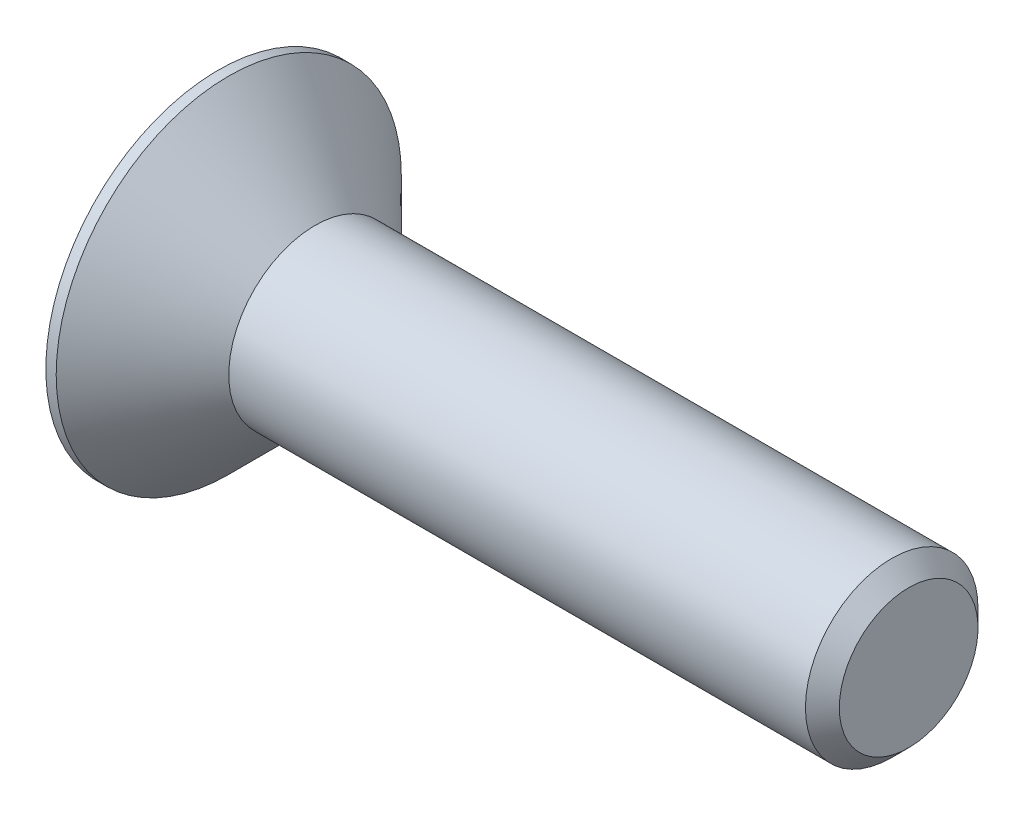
ISO-10303-21;
HEADER;
FILE_DESCRIPTION(('STEP AP214'),'2;1');
FILE_NAME('part.step','',(''),(''),'','','');
FILE_SCHEMA(('AUTOMOTIVE_DESIGN { 1 0 10303 214 1 1 1 1 }'));
ENDSEC;
DATA;
#1=APPLICATION_CONTEXT('core data for automotive mechanical design processes');
#2=APPLICATION_PROTOCOL_DEFINITION('international standard','automotive_design',2000,#1);
#3=PRODUCT_CONTEXT('',#1,'mechanical');
#4=PRODUCT('Part','Part','',(#3));
#5=PRODUCT_RELATED_PRODUCT_CATEGORY('part','',(#4));
#6=PRODUCT_DEFINITION_FORMATION('','',#4);
#7=PRODUCT_DEFINITION_CONTEXT('part definition',#1,'design');
#8=PRODUCT_DEFINITION('design','',#6,#7);
#9=PRODUCT_DEFINITION_SHAPE('','',#8);
#10=(LENGTH_UNIT() NAMED_UNIT(*) SI_UNIT(.MILLI.,.METRE.));
#11=(NAMED_UNIT(*) PLANE_ANGLE_UNIT() SI_UNIT($,.RADIAN.));
#12=(NAMED_UNIT(*) SI_UNIT($,.STERADIAN.) SOLID_ANGLE_UNIT());
#13=UNCERTAINTY_MEASURE_WITH_UNIT(LENGTH_MEASURE(1.E-05),#10,'distance_accuracy_value','');
#14=(GEOMETRIC_REPRESENTATION_CONTEXT(3) GLOBAL_UNCERTAINTY_ASSIGNED_CONTEXT((#13)) GLOBAL_UNIT_ASSIGNED_CONTEXT((#10,
#11,#12)) REPRESENTATION_CONTEXT('',''));
#15=CARTESIAN_POINT('',(0.,0.,0.));
#16=DIRECTION('',(0.,0.,1.));
#17=DIRECTION('',(1.,0.,0.));
#18=AXIS2_PLACEMENT_3D('',#15,#16,#17);
#19=CARTESIAN_POINT('',(0.,1.5,0.866025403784));
#20=DIRECTION('',(0.,1.,0.));
#21=DIRECTION('',(0.,0.,1.));
#22=AXIS2_PLACEMENT_3D('',#19,#20,#21);
#23=PLANE('',#22);
#24=DIRECTION('',(0.,0.,1.));
#25=VECTOR('',#24,1.);
#26=CARTESIAN_POINT('',(0.,1.5,0.866025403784));
#27=LINE('',#26,#25);
#28=CARTESIAN_POINT('',(0.,1.5,-0.866025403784));
#29=VERTEX_POINT('',#28);
#30=CARTESIAN_POINT('',(0.,1.50000000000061,0.866025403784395));
#31=VERTEX_POINT('',#30);
#32=EDGE_CURVE('E87',#29,#31,#27,.T.);
#33=ORIENTED_EDGE('',*,*,#32,.F.);
#34=DIRECTION('',(1.,0.,0.));
#35=VECTOR('',#34,1.);
#36=CARTESIAN_POINT('',(0.,1.5,-0.866025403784));
#37=LINE('',#36,#35);
#38=CARTESIAN_POINT('',(2.30000001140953,1.5,-0.866025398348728));
#39=VERTEX_POINT('',#38);
#40=EDGE_CURVE('E90',#29,#39,#37,.T.);
#41=ORIENTED_EDGE('',*,*,#40,.T.);
#42=CARTESIAN_POINT('',(2.30000000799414,1.49999999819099,0.866025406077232));
#43=CARTESIAN_POINT('',(2.32052467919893,1.49999999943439,0.794933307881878));
#44=CARTESIAN_POINT('',(2.3393155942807,1.49999999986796,0.723278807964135));
#45=CARTESIAN_POINT('',(2.37252620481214,1.50000000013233,0.578805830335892));
#46=CARTESIAN_POINT('',(2.38693611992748,1.49999999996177,0.505985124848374));
#47=CARTESIAN_POINT('',(2.41010900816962,1.50000000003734,0.361160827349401));
#48=CARTESIAN_POINT('',(2.41899552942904,1.50000000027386,0.289177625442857));
#49=CARTESIAN_POINT('',(2.43092515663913,1.49999999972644,0.144795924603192));
#50=CARTESIAN_POINT('',(2.43397460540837,1.49999999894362,0.0723979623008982));
#51=CARTESIAN_POINT('',(2.43397460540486,1.49999999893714,-0.0723979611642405));
#52=CARTESIAN_POINT('',(2.43092515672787,1.49999999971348,-0.144795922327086));
#53=CARTESIAN_POINT('',(2.41899552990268,1.50000000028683,-0.289177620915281));
#54=CARTESIAN_POINT('',(2.41010900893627,1.50000000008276,-0.361160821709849));
#55=CARTESIAN_POINT('',(2.38693612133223,1.49999999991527,-0.505985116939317));
#56=CARTESIAN_POINT('',(2.3725262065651,1.49999999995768,-0.578805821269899));
#57=CARTESIAN_POINT('',(2.33931559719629,1.50000000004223,-0.72327879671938));
#58=CARTESIAN_POINT('',(2.32052468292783,1.50000000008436,-0.794933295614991));
#59=CARTESIAN_POINT('',(2.30000001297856,1.5,-0.866025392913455));
#60=B_SPLINE_CURVE_WITH_KNOTS('',3,(#42,#43,#44,#45,#46,#47,#48,#49,#50,#51,#52,#53,#54,#55,#56,
#57,#58,#59),.UNSPECIFIED.,.F.,.F.,(4,2,2,2,2,2,2,2,4),(0.,0.222055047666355,0.444602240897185,
0.661973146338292,0.879107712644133,1.09624227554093,1.31361317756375,1.53616036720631,
1.7582154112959),.UNSPECIFIED.);
#61=CARTESIAN_POINT('',(2.3000000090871,1.50000000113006,0.866025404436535));
#62=VERTEX_POINT('',#61);
#63=EDGE_CURVE('E21',#62,#39,#60,.T.);
#64=ORIENTED_EDGE('',*,*,#63,.F.);
#65=DIRECTION('',(1.,0.,0.));
#66=VECTOR('',#65,1.);
#67=CARTESIAN_POINT('',(0.,1.50000000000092,0.866025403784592));
#68=LINE('',#67,#66);
#69=EDGE_CURVE('E129',#62,#31,#68,.F.);
#70=ORIENTED_EDGE('',*,*,#69,.T.);
#71=EDGE_LOOP('',(#33,#41,#64,#70));
#72=FACE_BOUND('',#71,.T.);
#73=ADVANCED_FACE('F17',(#72),#23,.F.);
#74=CARTESIAN_POINT('',(0.,0.,1.73205080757));
#75=DIRECTION('',(0.,0.50000000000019,0.866025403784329));
#76=DIRECTION('',(0.,-0.866025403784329,0.50000000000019));
#77=AXIS2_PLACEMENT_3D('',#74,#75,#76);
#78=PLANE('',#77);
#79=DIRECTION('',(0.,-0.866025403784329,0.50000000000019));
#80=VECTOR('',#79,1.);
#81=CARTESIAN_POINT('',(0.,0.,1.73205080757));
#82=LINE('',#81,#80);
#83=CARTESIAN_POINT('',(0.,-2.1098066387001E-09,1.73205080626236));
#84=VERTEX_POINT('',#83);
#85=EDGE_CURVE('E103',#31,#84,#82,.T.);
#86=ORIENTED_EDGE('',*,*,#85,.F.);
#87=ORIENTED_EDGE('',*,*,#69,.F.);
#88=CARTESIAN_POINT('',(2.30000000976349,-9.9609574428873E-10,1.7320508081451));
#89=CARTESIAN_POINT('',(2.32197835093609,0.0659159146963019,1.69399423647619));
#90=CARTESIAN_POINT('',(2.34196650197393,0.13240081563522,1.65560916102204));
#91=CARTESIAN_POINT('',(2.37685521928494,0.266521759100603,1.5781743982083));
#92=CARTESIAN_POINT('',(2.39174344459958,0.334160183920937,1.53912333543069));
#93=CARTESIAN_POINT('',(2.41491804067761,0.468598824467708,1.46150515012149));
#94=CARTESIAN_POINT('',(2.42335866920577,0.535378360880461,1.42294996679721));
#95=CARTESIAN_POINT('',(2.433433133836,0.669251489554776,1.3456582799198));
#96=CARTESIAN_POINT('',(2.43507531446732,0.736344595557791,1.30692205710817));
#97=CARTESIAN_POINT('',(2.43165029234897,0.861700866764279,1.23454758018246));
#98=CARTESIAN_POINT('',(2.427424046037,0.919982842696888,1.20089846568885));
#99=CARTESIAN_POINT('',(2.41403203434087,1.03616710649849,1.13381944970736));
#100=CARTESIAN_POINT('',(2.40486169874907,1.09406899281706,1.10038978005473));
#101=CARTESIAN_POINT('',(2.3819376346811,1.21049260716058,1.03317257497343));
#102=CARTESIAN_POINT('',(2.36808677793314,1.26899960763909,0.999393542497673));
#103=CARTESIAN_POINT('',(2.33665118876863,1.38514122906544,0.932339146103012));
#104=CARTESIAN_POINT('',(2.31907383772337,1.44277733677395,0.899062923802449));
#105=CARTESIAN_POINT('',(2.3000000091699,1.50000000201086,0.866025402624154));
#106=B_SPLINE_CURVE_WITH_KNOTS('',3,(#88,#89,#90,#91,#92,#93,#94,#95,#96,#97,#98,#99,#100,#101,
#102,#103,#104,#105),.UNSPECIFIED.,.F.,.F.,(4,2,2,2,2,2,2,2,4),(0.,0.237762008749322,
0.476095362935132,0.708530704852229,0.940680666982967,1.14278083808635,1.34506814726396,
1.55184121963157,1.75820848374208),.UNSPECIFIED.);
#107=CARTESIAN_POINT('',(2.30000001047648,-1.44596111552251E-09,1.73205080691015));
#108=VERTEX_POINT('',#107);
#109=EDGE_CURVE('E83',#108,#62,#106,.T.);
#110=ORIENTED_EDGE('',*,*,#109,.F.);
#111=DIRECTION('',(1.,0.,0.));
#112=VECTOR('',#111,1.);
#113=CARTESIAN_POINT('',(0.,-3.28006176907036E-09,1.73205080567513));
#114=LINE('',#113,#112);
#115=EDGE_CURVE('E204',#108,#84,#114,.F.);
#116=ORIENTED_EDGE('',*,*,#115,.T.);
#117=EDGE_LOOP('',(#86,#87,#110,#116));
#118=FACE_BOUND('',#117,.T.);
#119=ADVANCED_FACE('F130',(#118),#78,.F.);
#120=CARTESIAN_POINT('',(2.29400000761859,-5.11590769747E-10,0.));
#121=DIRECTION('',(-1.,0.,0.));
#122=DIRECTION('',(0.,0.,1.));
#123=AXIS2_PLACEMENT_3D('',#120,#121,#122);
#124=CONICAL_SURFACE('',#123,1.74244311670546,1.04719755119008);
#125=CARTESIAN_POINT('',(3.30000001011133,-5.11590769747E-10,-2.22044604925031E-13));
#126=VERTEX_POINT('',#125);
#127=VERTEX_LOOP('',#126);
#128=FACE_BOUND('',#127,.T.);
#129=CARTESIAN_POINT('',(2.30000000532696,1.50000001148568,-0.866025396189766));
#130=CARTESIAN_POINT('',(2.32197834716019,1.43408409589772,-0.904081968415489));
#131=CARTESIAN_POINT('',(2.3419664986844,1.36759919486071,-0.942467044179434));
#132=CARTESIAN_POINT('',(2.37685521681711,1.23347825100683,-1.01990180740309));
#133=CARTESIAN_POINT('',(2.39174344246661,1.16583982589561,-1.05895287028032));
#134=CARTESIAN_POINT('',(2.41491803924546,1.03140118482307,-1.13657105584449));
#135=CARTESIAN_POINT('',(2.42335866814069,0.964621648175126,-1.17512623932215));
#136=CARTESIAN_POINT('',(2.43343313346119,0.830748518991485,-1.2524179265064));
#137=CARTESIAN_POINT('',(2.43507531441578,0.763655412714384,-1.29115414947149));
#138=CARTESIAN_POINT('',(2.43165029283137,0.638299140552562,-1.36352862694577));
#139=CARTESIAN_POINT('',(2.42742404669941,0.580017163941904,-1.39717774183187));
#140=CARTESIAN_POINT('',(2.41403203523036,0.463832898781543,-1.46425675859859));
#141=CARTESIAN_POINT('',(2.40486169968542,0.405931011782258,-1.49768642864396));
#142=CARTESIAN_POINT('',(2.38193763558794,0.289507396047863,-1.56490363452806));
#143=CARTESIAN_POINT('',(2.36808677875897,0.231000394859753,-1.59868266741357));
#144=CARTESIAN_POINT('',(2.33665118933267,0.114858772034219,-1.66573706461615));
#145=CARTESIAN_POINT('',(2.31907383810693,0.0572226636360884,-1.69901328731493));
#146=CARTESIAN_POINT('',(2.30000000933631,-2.27960504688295E-09,-1.73205080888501));
#147=B_SPLINE_CURVE_WITH_KNOTS('',3,(#129,#130,#131,#132,#133,#134,#135,#136,#137,#138,#139,
#140,#141,#142,#143,#144,#145,#146),.UNSPECIFIED.,.F.,.F.,(4,2,2,2,2,2,2,2,4),(0.,
0.237762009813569,0.476095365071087,0.708530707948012,0.94068067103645,1.14278084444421,
1.34506815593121,1.55184123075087,1.75820849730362),.UNSPECIFIED.);
#148=CARTESIAN_POINT('',(2.30000000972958,-1.34848827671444E-09,-1.73205080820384));
#149=VERTEX_POINT('',#148);
#150=EDGE_CURVE('E80',#39,#149,#147,.T.);
#151=ORIENTED_EDGE('',*,*,#150,.T.);
#152=CARTESIAN_POINT('',(2.30000000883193,2.28362544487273E-09,-1.73205080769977));
#153=CARTESIAN_POINT('',(2.32197835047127,-0.0659159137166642,-1.69399423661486));
#154=CARTESIAN_POINT('',(2.34196650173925,-0.132400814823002,-1.65560916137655));
#155=CARTESIAN_POINT('',(2.37685521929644,-0.266521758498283,-1.57817439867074));
#156=CARTESIAN_POINT('',(2.39174344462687,-0.33416018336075,-1.53912333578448));
#157=CARTESIAN_POINT('',(2.41491804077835,-0.468598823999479,-1.46150515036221));
#158=CARTESIAN_POINT('',(2.42335866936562,-0.535378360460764,-1.42294996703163));
#159=CARTESIAN_POINT('',(2.43343313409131,-0.669251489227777,-1.34565828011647));
#160=CARTESIAN_POINT('',(2.43507531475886,-0.736344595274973,-1.30692205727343));
#161=CARTESIAN_POINT('',(2.43165029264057,-0.861700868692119,-1.2345475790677));
#162=CARTESIAN_POINT('',(2.42742404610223,-0.919982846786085,-1.20089846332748));
#163=CARTESIAN_POINT('',(2.41403203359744,-1.03616711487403,-1.1338194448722));
#164=CARTESIAN_POINT('',(2.40486169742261,-1.09406900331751,-1.10038977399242));
#165=CARTESIAN_POINT('',(2.38193763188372,-1.21049262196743,-1.03317256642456));
#166=CARTESIAN_POINT('',(2.36808677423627,-1.26899962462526,-0.999393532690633));
#167=CARTESIAN_POINT('',(2.33665118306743,-1.38514125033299,-0.932339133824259));
#168=CARTESIAN_POINT('',(2.31907383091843,-1.4427773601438,-0.899062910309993));
#169=CARTESIAN_POINT('',(2.30000000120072,-1.5000000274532,-0.866025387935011));
#170=B_SPLINE_CURVE_WITH_KNOTS('',3,(#152,#153,#154,#155,#156,#157,#158,#159,#160,#161,#162,
#163,#164,#165,#166,#167,#168,#169),.UNSPECIFIED.,.F.,.F.,(4,2,2,2,2,2,2,2,4),(0.,
0.237762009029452,0.476095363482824,0.70853070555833,0.940680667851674,1.14278084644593,
1.34506816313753,1.55184124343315,1.75820851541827),.UNSPECIFIED.);
#171=CARTESIAN_POINT('',(2.30000001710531,-1.5000000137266,-0.866025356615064));
#172=VERTEX_POINT('',#171);
#173=EDGE_CURVE('E139',#149,#172,#170,.T.);
#174=ORIENTED_EDGE('',*,*,#173,.T.);
#175=CARTESIAN_POINT('',(2.30000000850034,-1.49999999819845,0.866025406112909));
#176=CARTESIAN_POINT('',(2.32052467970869,-1.49999999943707,0.794933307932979));
#177=CARTESIAN_POINT('',(2.33931559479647,-1.49999999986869,0.723278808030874));
#178=CARTESIAN_POINT('',(2.37252620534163,-1.5000000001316,0.578805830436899));
#179=CARTESIAN_POINT('',(2.38693612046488,-1.49999999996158,0.505985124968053));
#180=CARTESIAN_POINT('',(2.41010900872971,-1.50000000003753,0.361160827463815));
#181=CARTESIAN_POINT('',(2.41899553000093,-1.50000000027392,0.289177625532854));
#182=CARTESIAN_POINT('',(2.43092515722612,-1.49999999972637,0.144795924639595));
#183=CARTESIAN_POINT('',(2.43397460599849,-1.49999999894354,0.0723979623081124));
#184=CARTESIAN_POINT('',(2.43397460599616,-1.49999999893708,-0.0723979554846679));
#185=CARTESIAN_POINT('',(2.43092515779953,-1.49999999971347,-0.144795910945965));
#186=CARTESIAN_POINT('',(2.41899553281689,-1.50000000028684,-0.289177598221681));
#187=CARTESIAN_POINT('',(2.41010901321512,-1.50000000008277,-0.361160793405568));
#188=CARTESIAN_POINT('',(2.3869361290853,-1.49999999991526,-0.505985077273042));
#189=CARTESIAN_POINT('',(2.37252621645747,-1.49999999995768,-0.578805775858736));
#190=CARTESIAN_POINT('',(2.3393156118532,-1.50000000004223,-0.723278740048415));
#191=CARTESIAN_POINT('',(2.32052470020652,-1.50000000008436,-0.794933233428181));
#192=CARTESIAN_POINT('',(2.3000000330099,-1.5,-0.866025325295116));
#193=B_SPLINE_CURVE_WITH_KNOTS('',3,(#175,#176,#177,#178,#179,#180,#181,#182,#183,#184,#185,
#186,#187,#188,#189,#190,#191,#192),.UNSPECIFIED.,.F.,.F.,(4,2,2,2,2,2,2,2,4),(0.,
0.222055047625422,0.444602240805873,0.661973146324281,0.87910771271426,1.09624225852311,
1.31361314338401,1.53616031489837,1.75821534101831),.UNSPECIFIED.);
#194=CARTESIAN_POINT('',(2.30000000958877,-1.50000000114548,0.866025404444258));
#195=VERTEX_POINT('',#194);
#196=EDGE_CURVE('E100',#195,#172,#193,.T.);
#197=ORIENTED_EDGE('',*,*,#196,.F.);
#198=CARTESIAN_POINT('',(2.3000000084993,-1.50000000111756,0.866025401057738));
#199=CARTESIAN_POINT('',(2.32197835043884,-1.43408408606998,0.904081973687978));
#200=CARTESIAN_POINT('',(2.34196650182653,-1.3675991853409,0.942467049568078));
#201=CARTESIAN_POINT('',(2.37685521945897,-1.23347824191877,1.01990181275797));
#202=CARTESIAN_POINT('',(2.39174344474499,-1.16583981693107,1.05895287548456));
#203=CARTESIAN_POINT('',(2.41491804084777,-1.03140117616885,1.13657106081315));
#204=CARTESIAN_POINT('',(2.42335866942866,-0.964621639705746,1.17512624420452));
#205=CARTESIAN_POINT('',(2.4334331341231,-0.830748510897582,1.25241793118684));
#206=CARTESIAN_POINT('',(2.43507531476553,-0.763655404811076,1.29115415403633));
#207=CARTESIAN_POINT('',(2.43165029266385,-0.638299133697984,1.36352863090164));
#208=CARTESIAN_POINT('',(2.42742404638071,-0.580017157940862,1.39717774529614));
#209=CARTESIAN_POINT('',(2.41403203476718,-0.463832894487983,1.46425676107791));
#210=CARTESIAN_POINT('',(2.4048616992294,-0.405931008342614,1.49768643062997));
#211=CARTESIAN_POINT('',(2.38193763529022,-0.289507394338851,1.56490363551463));
#212=CARTESIAN_POINT('',(2.36808677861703,-0.231000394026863,1.59868266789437));
#213=CARTESIAN_POINT('',(2.3366511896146,-0.114858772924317,1.66573706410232));
#214=CARTESIAN_POINT('',(2.31907383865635,-0.0572226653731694,1.69901328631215));
#215=CARTESIAN_POINT('',(2.30000001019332,-2.91394939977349E-10,1.73205080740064));
#216=B_SPLINE_CURVE_WITH_KNOTS('',3,(#198,#199,#200,#201,#202,#203,#204,#205,#206,#207,#208,
#209,#210,#211,#212,#213,#214,#215),.UNSPECIFIED.,.F.,.F.,(4,2,2,2,2,2,2,2,4),(0.,
0.237762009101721,0.476095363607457,0.708530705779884,0.940680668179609,1.14278083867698,
1.34506814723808,1.5518412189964,1.75820848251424),.UNSPECIFIED.);
#217=EDGE_CURVE('E93',#195,#108,#216,.T.);
#218=ORIENTED_EDGE('',*,*,#217,.T.);
#219=ORIENTED_EDGE('',*,*,#109,.T.);
#220=ORIENTED_EDGE('',*,*,#63,.T.);
#221=EDGE_LOOP('',(#151,#174,#197,#218,#219,#220));
#222=FACE_BOUND('',#221,.T.);
#223=ADVANCED_FACE('F77',(#128,#222),#124,.F.);
#224=CARTESIAN_POINT('',(0.,1.5,-0.866025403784));
#225=DIRECTION('',(0.,0.50000000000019,-0.866025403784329));
#226=DIRECTION('',(0.,0.866025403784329,0.50000000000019));
#227=AXIS2_PLACEMENT_3D('',#224,#225,#226);
#228=PLANE('',#227);
#229=DIRECTION('',(0.,0.866025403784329,0.50000000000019));
#230=VECTOR('',#229,1.);
#231=CARTESIAN_POINT('',(0.,1.5,-0.866025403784));
#232=LINE('',#231,#230);
#233=CARTESIAN_POINT('',(0.,-2.08217435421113E-10,-1.73205080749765));
#234=VERTEX_POINT('',#233);
#235=EDGE_CURVE('E94',#234,#29,#232,.T.);
#236=ORIENTED_EDGE('',*,*,#235,.F.);
#237=DIRECTION('',(1.,0.,0.));
#238=VECTOR('',#237,1.);
#239=CARTESIAN_POINT('',(0.,-2.49666401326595E-10,-1.73205080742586));
#240=LINE('',#239,#238);
#241=EDGE_CURVE('E98',#234,#149,#240,.T.);
#242=ORIENTED_EDGE('',*,*,#241,.T.);
#243=ORIENTED_EDGE('',*,*,#150,.F.);
#244=ORIENTED_EDGE('',*,*,#40,.F.);
#245=EDGE_LOOP('',(#236,#242,#243,#244));
#246=FACE_BOUND('',#245,.T.);
#247=ADVANCED_FACE('F96',(#246),#228,.F.);
#248=CARTESIAN_POINT('',(0.,-1.5,0.866025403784));
#249=DIRECTION('',(0.,-0.50000000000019,0.866025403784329));
#250=DIRECTION('',(0.,-0.866025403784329,-0.50000000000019));
#251=AXIS2_PLACEMENT_3D('',#248,#249,#250);
#252=PLANE('',#251);
#253=DIRECTION('',(0.,-0.866025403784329,-0.50000000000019));
#254=VECTOR('',#253,1.);
#255=CARTESIAN_POINT('',(0.,-1.5,0.866025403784));
#256=LINE('',#255,#254);
#257=CARTESIAN_POINT('',(0.,-1.49999999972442,0.866025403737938));
#258=VERTEX_POINT('',#257);
#259=EDGE_CURVE('E41',#84,#258,#256,.T.);
#260=ORIENTED_EDGE('',*,*,#259,.F.);
#261=ORIENTED_EDGE('',*,*,#115,.F.);
#262=ORIENTED_EDGE('',*,*,#217,.F.);
#263=DIRECTION('',(1.,0.,0.));
#264=VECTOR('',#263,1.);
#265=CARTESIAN_POINT('',(0.,-1.5,0.866025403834));
#266=LINE('',#265,#264);
#267=EDGE_CURVE('E217',#195,#258,#266,.F.);
#268=ORIENTED_EDGE('',*,*,#267,.T.);
#269=EDGE_LOOP('',(#260,#261,#262,#268));
#270=FACE_BOUND('',#269,.T.);
#271=ADVANCED_FACE('F152',(#270),#252,.F.);
#272=CARTESIAN_POINT('',(0.,0.,-1.73205080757));
#273=DIRECTION('',(0.,-0.50000000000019,-0.866025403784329));
#274=DIRECTION('',(0.,0.866025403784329,-0.50000000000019));
#275=AXIS2_PLACEMENT_3D('',#272,#273,#274);
#276=PLANE('',#275);
#277=DIRECTION('',(0.,0.866025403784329,-0.50000000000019));
#278=VECTOR('',#277,1.);
#279=CARTESIAN_POINT('',(0.,0.,-1.73205080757));
#280=LINE('',#279,#278);
#281=CARTESIAN_POINT('',(0.,-1.49999999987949,-0.866025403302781));
#282=VERTEX_POINT('',#281);
#283=EDGE_CURVE('E145',#282,#234,#280,.T.);
#284=ORIENTED_EDGE('',*,*,#283,.F.);
#285=DIRECTION('',(1.,0.,0.));
#286=VECTOR('',#285,1.);
#287=CARTESIAN_POINT('',(0.,-1.5,-0.866025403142));
#288=LINE('',#287,#286);
#289=EDGE_CURVE('E209',#282,#172,#288,.T.);
#290=ORIENTED_EDGE('',*,*,#289,.T.);
#291=ORIENTED_EDGE('',*,*,#173,.F.);
#292=ORIENTED_EDGE('',*,*,#241,.F.);
#293=EDGE_LOOP('',(#284,#290,#291,#292));
#294=FACE_BOUND('',#293,.T.);
#295=ADVANCED_FACE('F148',(#294),#276,.F.);
#296=CARTESIAN_POINT('',(0.,-1.5,-0.866025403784));
#297=DIRECTION('',(0.,-1.,0.));
#298=DIRECTION('',(0.,0.,-1.));
#299=AXIS2_PLACEMENT_3D('',#296,#297,#298);
#300=PLANE('',#299);
#301=DIRECTION('',(0.,0.,1.));
#302=VECTOR('',#301,1.);
#303=CARTESIAN_POINT('',(0.,-1.49999999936,0.));
#304=LINE('',#303,#302);
#305=EDGE_CURVE('E207',#258,#282,#304,.F.);
#306=ORIENTED_EDGE('',*,*,#305,.F.);
#307=ORIENTED_EDGE('',*,*,#267,.F.);
#308=ORIENTED_EDGE('',*,*,#196,.T.);
#309=ORIENTED_EDGE('',*,*,#289,.F.);
#310=EDGE_LOOP('',(#306,#307,#308,#309));
#311=FACE_BOUND('',#310,.T.);
#312=ADVANCED_FACE('F151',(#311),#300,.F.);
#313=CARTESIAN_POINT('',(0.,3.36602540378,0.));
#314=DIRECTION('',(-1.,0.,0.));
#315=DIRECTION('',(0.,-1.,0.));
#316=AXIS2_PLACEMENT_3D('',#313,#314,#315);
#317=PLANE('',#316);
#318=ORIENTED_EDGE('',*,*,#259,.T.);
#319=ORIENTED_EDGE('',*,*,#305,.T.);
#320=ORIENTED_EDGE('',*,*,#283,.T.);
#321=ORIENTED_EDGE('',*,*,#235,.T.);
#322=ORIENTED_EDGE('',*,*,#32,.T.);
#323=ORIENTED_EDGE('',*,*,#85,.T.);
#324=EDGE_LOOP('',(#318,#319,#320,#321,#322,#323));
#325=FACE_BOUND('',#324,.T.);
#326=CARTESIAN_POINT('',(-1.86269429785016E-10,0.,0.));
#327=DIRECTION('',(1.,0.,0.));
#328=DIRECTION('',(0.,0.,-1.));
#329=AXIS2_PLACEMENT_3D('',#326,#327,#328);
#330=CIRCLE('',#329,5.);
#331=CARTESIAN_POINT('',(-1.86269429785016E-10,0.,-5.));
#332=VERTEX_POINT('',#331);
#333=EDGE_CURVE('E146',#332,#332,#330,.T.);
#334=ORIENTED_EDGE('',*,*,#333,.F.);
#335=EDGE_LOOP('',(#334));
#336=FACE_BOUND('',#335,.T.);
#337=ADVANCED_FACE('F158',(#325,#336),#317,.T.);
#338=CARTESIAN_POINT('',(0.15,0.,0.));
#339=DIRECTION('',(1.,0.,0.));
#340=DIRECTION('',(0.,0.,-1.));
#341=AXIS2_PLACEMENT_3D('',#338,#339,#340);
#342=CYLINDRICAL_SURFACE('',#341,5.);
#343=CARTESIAN_POINT('',(0.300000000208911,0.,0.));
#344=DIRECTION('',(-1.,0.,0.));
#345=DIRECTION('',(0.,0.,1.));
#346=AXIS2_PLACEMENT_3D('',#343,#344,#345);
#347=CIRCLE('',#346,4.99999999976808);
#348=CARTESIAN_POINT('',(0.300000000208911,0.,4.99999999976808));
#349=VERTEX_POINT('',#348);
#350=EDGE_CURVE('E187',#349,#349,#347,.F.);
#351=ORIENTED_EDGE('',*,*,#350,.F.);
#352=EDGE_LOOP('',(#351));
#353=FACE_BOUND('',#352,.T.);
#354=ORIENTED_EDGE('',*,*,#333,.T.);
#355=EDGE_LOOP('',(#354));
#356=FACE_BOUND('',#355,.T.);
#357=ADVANCED_FACE('F162',(#353,#356),#342,.T.);
#358=CARTESIAN_POINT('',(20.,1.25,0.));
#359=DIRECTION('',(1.,0.,0.));
#360=DIRECTION('',(0.,1.,0.));
#361=AXIS2_PLACEMENT_3D('',#358,#359,#360);
#362=PLANE('',#361);
#363=CARTESIAN_POINT('',(20.0000000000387,0.,0.));
#364=DIRECTION('',(-1.,0.,0.));
#365=DIRECTION('',(0.,0.,1.));
#366=AXIS2_PLACEMENT_3D('',#363,#364,#365);
#367=CIRCLE('',#366,2.009239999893);
#368=CARTESIAN_POINT('',(20.0000000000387,0.,2.009239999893));
#369=VERTEX_POINT('',#368);
#370=EDGE_CURVE('E184',#369,#369,#367,.T.);
#371=ORIENTED_EDGE('',*,*,#370,.F.);
#372=EDGE_LOOP('',(#371));
#373=FACE_BOUND('',#372,.T.);
#374=ADVANCED_FACE('F165',(#373),#362,.T.);
#375=CARTESIAN_POINT('',(0.300000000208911,0.,0.));
#376=DIRECTION('',(-1.,0.,0.));
#377=DIRECTION('',(0.,0.,1.));
#378=AXIS2_PLACEMENT_3D('',#375,#376,#377);
#379=CONICAL_SURFACE('',#378,4.99999999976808,0.785398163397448);
#380=ORIENTED_EDGE('',*,*,#350,.T.);
#381=EDGE_LOOP('',(#380));
#382=FACE_BOUND('',#381,.T.);
#383=CARTESIAN_POINT('',(2.79999999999,0.,0.));
#384=DIRECTION('',(1.,0.,0.));
#385=DIRECTION('',(0.,0.,-1.));
#386=AXIS2_PLACEMENT_3D('',#383,#384,#385);
#387=CIRCLE('',#386,2.5);
#388=CARTESIAN_POINT('',(2.79999999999,0.,-2.5));
#389=VERTEX_POINT('',#388);
#390=EDGE_CURVE('E32',#389,#389,#387,.T.);
#391=ORIENTED_EDGE('',*,*,#390,.F.);
#392=EDGE_LOOP('',(#391));
#393=FACE_BOUND('',#392,.T.);
#394=ADVANCED_FACE('F169',(#382,#393),#379,.T.);
#395=CARTESIAN_POINT('',(19.5092399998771,0.,0.));
#396=DIRECTION('',(-1.,0.,0.));
#397=DIRECTION('',(0.,0.,1.));
#398=AXIS2_PLACEMENT_3D('',#395,#396,#397);
#399=CONICAL_SURFACE('',#398,2.49999999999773,0.785398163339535);
#400=ORIENTED_EDGE('',*,*,#370,.T.);
#401=EDGE_LOOP('',(#400));
#402=FACE_BOUND('',#401,.T.);
#403=CARTESIAN_POINT('',(19.5092399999,0.,0.));
#404=DIRECTION('',(1.,0.,0.));
#405=DIRECTION('',(0.,0.,-1.));
#406=AXIS2_PLACEMENT_3D('',#403,#404,#405);
#407=CIRCLE('',#406,2.5);
#408=CARTESIAN_POINT('',(19.5092399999,0.,-2.5));
#409=VERTEX_POINT('',#408);
#410=EDGE_CURVE('E11',#409,#409,#407,.F.);
#411=ORIENTED_EDGE('',*,*,#410,.F.);
#412=EDGE_LOOP('',(#411));
#413=FACE_BOUND('',#412,.T.);
#414=ADVANCED_FACE('F172',(#402,#413),#399,.T.);
#415=CARTESIAN_POINT('',(12.6,0.,0.));
#416=DIRECTION('',(1.,0.,0.));
#417=DIRECTION('',(0.,0.,-1.));
#418=AXIS2_PLACEMENT_3D('',#415,#416,#417);
#419=CYLINDRICAL_SURFACE('',#418,2.5);
#420=ORIENTED_EDGE('',*,*,#390,.T.);
#421=EDGE_LOOP('',(#420));
#422=FACE_BOUND('',#421,.T.);
#423=ORIENTED_EDGE('',*,*,#410,.T.);
#424=EDGE_LOOP('',(#423));
#425=FACE_BOUND('',#424,.T.);
#426=ADVANCED_FACE('F19',(#422,#425),#419,.T.);
#427=CLOSED_SHELL('',(#73,#119,#223,#247,#271,#295,#312,#337,#357,#374,#394,#414,#426));
#428=MANIFOLD_SOLID_BREP('B1',#427);
#429=ADVANCED_BREP_SHAPE_REPRESENTATION('',(#18,#428),#14);
#430=SHAPE_DEFINITION_REPRESENTATION(#9,#429);
ENDSEC;
END-ISO-10303-21;
